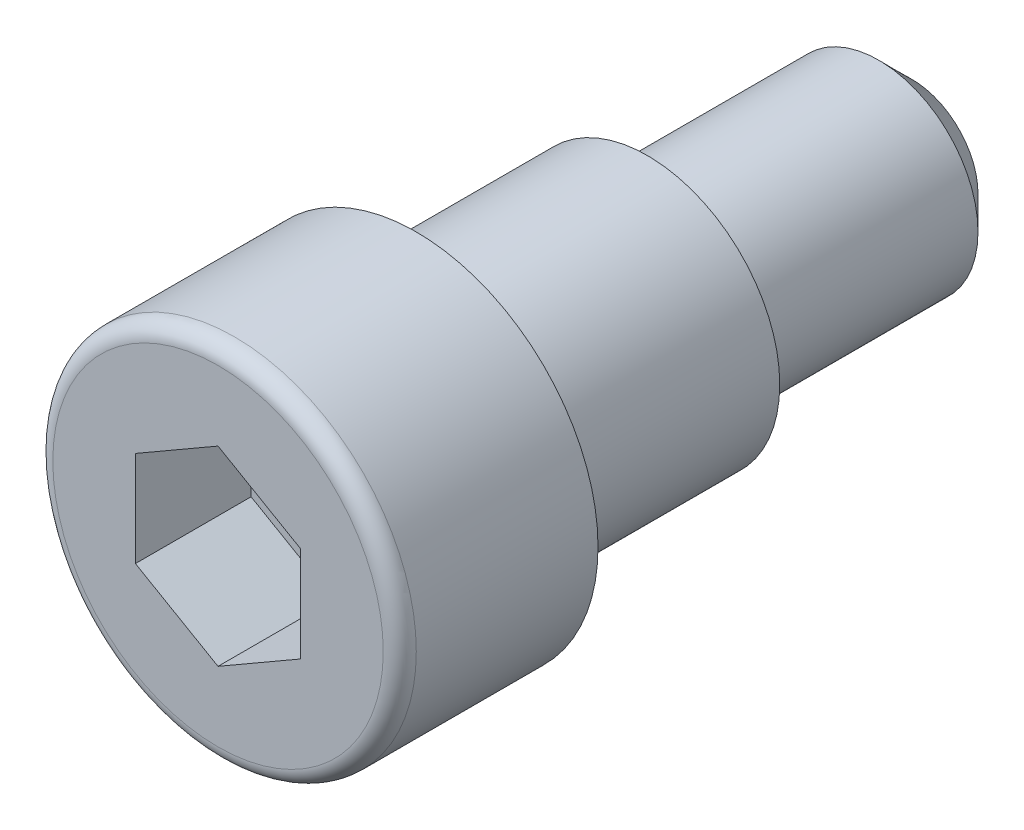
ISO-10303-21;
HEADER;
FILE_DESCRIPTION(('STEP AP214'),'2;1');
FILE_NAME('part.step','',(''),(''),'','','');
FILE_SCHEMA(('AUTOMOTIVE_DESIGN { 1 0 10303 214 1 1 1 1 }'));
ENDSEC;
DATA;
#1=APPLICATION_CONTEXT('core data for automotive mechanical design processes');
#2=APPLICATION_PROTOCOL_DEFINITION('international standard','automotive_design',2000,#1);
#3=PRODUCT_CONTEXT('',#1,'mechanical');
#4=PRODUCT('Part','Part','',(#3));
#5=PRODUCT_RELATED_PRODUCT_CATEGORY('part','',(#4));
#6=PRODUCT_DEFINITION_FORMATION('','',#4);
#7=PRODUCT_DEFINITION_CONTEXT('part definition',#1,'design');
#8=PRODUCT_DEFINITION('design','',#6,#7);
#9=PRODUCT_DEFINITION_SHAPE('','',#8);
#10=(LENGTH_UNIT() NAMED_UNIT(*) SI_UNIT(.MILLI.,.METRE.));
#11=(NAMED_UNIT(*) PLANE_ANGLE_UNIT() SI_UNIT($,.RADIAN.));
#12=(NAMED_UNIT(*) SI_UNIT($,.STERADIAN.) SOLID_ANGLE_UNIT());
#13=UNCERTAINTY_MEASURE_WITH_UNIT(LENGTH_MEASURE(1.E-05),#10,'distance_accuracy_value','');
#14=(GEOMETRIC_REPRESENTATION_CONTEXT(3) GLOBAL_UNCERTAINTY_ASSIGNED_CONTEXT((#13)) GLOBAL_UNIT_ASSIGNED_CONTEXT((#10,
#11,#12)) REPRESENTATION_CONTEXT('',''));
#15=CARTESIAN_POINT('',(0.,0.,0.));
#16=DIRECTION('',(0.,0.,1.));
#17=DIRECTION('',(1.,0.,0.));
#18=AXIS2_PLACEMENT_3D('',#15,#16,#17);
#19=CARTESIAN_POINT('',(0.,0.,-15.));
#20=DIRECTION('',(0.,0.,1.));
#21=DIRECTION('',(1.,0.,0.));
#22=AXIS2_PLACEMENT_3D('',#19,#20,#21);
#23=PLANE('',#22);
#24=CARTESIAN_POINT('',(0.,0.,-15.));
#25=DIRECTION('',(0.,0.,1.));
#26=DIRECTION('',(1.,0.,0.));
#27=AXIS2_PLACEMENT_3D('',#24,#25,#26);
#28=CIRCLE('',#27,2.);
#29=CARTESIAN_POINT('',(2.,0.,-15.));
#30=VERTEX_POINT('',#29);
#31=EDGE_CURVE('E9',#30,#30,#28,.F.);
#32=ORIENTED_EDGE('',*,*,#31,.T.);
#33=EDGE_LOOP('',(#32));
#34=FACE_BOUND('',#33,.T.);
#35=ADVANCED_FACE('F14',(#34),#23,.F.);
#36=CARTESIAN_POINT('',(0.,0.,6.));
#37=DIRECTION('',(0.,0.,-1.));
#38=DIRECTION('',(-1.,0.,0.));
#39=AXIS2_PLACEMENT_3D('',#36,#37,#38);
#40=PLANE('',#39);
#41=CARTESIAN_POINT('',(0.,0.,6.));
#42=DIRECTION('',(0.,0.,-1.));
#43=DIRECTION('',(-1.,0.,0.));
#44=AXIS2_PLACEMENT_3D('',#41,#42,#43);
#45=CIRCLE('',#44,5.);
#46=CARTESIAN_POINT('',(-5.,0.,6.));
#47=VERTEX_POINT('',#46);
#48=EDGE_CURVE('E133',#47,#47,#45,.F.);
#49=ORIENTED_EDGE('',*,*,#48,.T.);
#50=EDGE_LOOP('',(#49));
#51=FACE_BOUND('',#50,.T.);
#52=DIRECTION('',(-0.866025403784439,-0.5,0.));
#53=VECTOR('',#52,1.);
#54=CARTESIAN_POINT('',(0.,2.88675134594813,6.));
#55=LINE('',#54,#53);
#56=CARTESIAN_POINT('',(0.,2.88675134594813,6.));
#57=VERTEX_POINT('',#56);
#58=CARTESIAN_POINT('',(-2.5,1.44337567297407,6.));
#59=VERTEX_POINT('',#58);
#60=EDGE_CURVE('E103',#57,#59,#55,.T.);
#61=ORIENTED_EDGE('',*,*,#60,.F.);
#62=DIRECTION('',(-0.866025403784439,0.5,0.));
#63=VECTOR('',#62,1.);
#64=CARTESIAN_POINT('',(2.5,1.44337567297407,6.));
#65=LINE('',#64,#63);
#66=CARTESIAN_POINT('',(2.5,1.44337567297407,6.));
#67=VERTEX_POINT('',#66);
#68=EDGE_CURVE('E29',#67,#57,#65,.T.);
#69=ORIENTED_EDGE('',*,*,#68,.F.);
#70=DIRECTION('',(0.,1.,0.));
#71=VECTOR('',#70,1.);
#72=CARTESIAN_POINT('',(2.5,-1.44337567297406,6.));
#73=LINE('',#72,#71);
#74=CARTESIAN_POINT('',(2.5,-1.44337567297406,6.));
#75=VERTEX_POINT('',#74);
#76=EDGE_CURVE('E112',#75,#67,#73,.T.);
#77=ORIENTED_EDGE('',*,*,#76,.F.);
#78=DIRECTION('',(0.866025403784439,0.5,0.));
#79=VECTOR('',#78,1.);
#80=CARTESIAN_POINT('',(0.,-2.88675134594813,6.));
#81=LINE('',#80,#79);
#82=CARTESIAN_POINT('',(0.,-2.88675134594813,6.));
#83=VERTEX_POINT('',#82);
#84=EDGE_CURVE('E110',#83,#75,#81,.T.);
#85=ORIENTED_EDGE('',*,*,#84,.F.);
#86=DIRECTION('',(0.866025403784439,-0.5,0.));
#87=VECTOR('',#86,1.);
#88=CARTESIAN_POINT('',(-2.5,-1.44337567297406,6.));
#89=LINE('',#88,#87);
#90=CARTESIAN_POINT('',(-2.5,-1.44337567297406,6.));
#91=VERTEX_POINT('',#90);
#92=EDGE_CURVE('E77',#91,#83,#89,.T.);
#93=ORIENTED_EDGE('',*,*,#92,.F.);
#94=DIRECTION('',(0.,-1.,0.));
#95=VECTOR('',#94,1.);
#96=CARTESIAN_POINT('',(-2.5,1.44337567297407,6.));
#97=LINE('',#96,#95);
#98=EDGE_CURVE('E106',#59,#91,#97,.T.);
#99=ORIENTED_EDGE('',*,*,#98,.F.);
#100=EDGE_LOOP('',(#61,#69,#77,#85,#93,#99));
#101=FACE_BOUND('',#100,.T.);
#102=ADVANCED_FACE('F155',(#51,#101),#40,.F.);
#103=CARTESIAN_POINT('',(0.,0.,10.));
#104=DIRECTION('',(0.,0.,1.));
#105=DIRECTION('',(1.,0.,0.));
#106=AXIS2_PLACEMENT_3D('',#103,#104,#105);
#107=CYLINDRICAL_SURFACE('',#106,5.5);
#108=CARTESIAN_POINT('',(0.,0.,5.5));
#109=DIRECTION('',(0.,0.,-1.));
#110=DIRECTION('',(-1.,0.,0.));
#111=AXIS2_PLACEMENT_3D('',#108,#109,#110);
#112=CIRCLE('',#111,5.5);
#113=CARTESIAN_POINT('',(-5.5,0.,5.5));
#114=VERTEX_POINT('',#113);
#115=EDGE_CURVE('E136',#114,#114,#112,.T.);
#116=ORIENTED_EDGE('',*,*,#115,.T.);
#117=EDGE_LOOP('',(#116));
#118=FACE_BOUND('',#117,.T.);
#119=CARTESIAN_POINT('',(0.,0.,0.));
#120=DIRECTION('',(0.,0.,1.));
#121=DIRECTION('',(1.,0.,0.));
#122=AXIS2_PLACEMENT_3D('',#119,#120,#121);
#123=CIRCLE('',#122,5.5);
#124=CARTESIAN_POINT('',(5.5,0.,0.));
#125=VERTEX_POINT('',#124);
#126=EDGE_CURVE('E130',#125,#125,#123,.T.);
#127=ORIENTED_EDGE('',*,*,#126,.T.);
#128=EDGE_LOOP('',(#127));
#129=FACE_BOUND('',#128,.T.);
#130=ADVANCED_FACE('F162',(#118,#129),#107,.T.);
#131=CARTESIAN_POINT('',(0.,4.,0.));
#132=DIRECTION('',(0.,0.,1.));
#133=DIRECTION('',(1.,0.,0.));
#134=AXIS2_PLACEMENT_3D('',#131,#132,#133);
#135=PLANE('',#134);
#136=ORIENTED_EDGE('',*,*,#126,.F.);
#137=EDGE_LOOP('',(#136));
#138=FACE_BOUND('',#137,.T.);
#139=CARTESIAN_POINT('',(0.,0.,0.));
#140=DIRECTION('',(0.,0.,1.));
#141=DIRECTION('',(1.,0.,0.));
#142=AXIS2_PLACEMENT_3D('',#139,#140,#141);
#143=CIRCLE('',#142,4.);
#144=CARTESIAN_POINT('',(4.,0.,0.));
#145=VERTEX_POINT('',#144);
#146=EDGE_CURVE('E127',#145,#145,#143,.T.);
#147=ORIENTED_EDGE('',*,*,#146,.T.);
#148=EDGE_LOOP('',(#147));
#149=FACE_BOUND('',#148,.T.);
#150=ADVANCED_FACE('F168',(#138,#149),#135,.F.);
#151=CARTESIAN_POINT('',(0.,0.,10.));
#152=DIRECTION('',(0.,0.,1.));
#153=DIRECTION('',(1.,0.,0.));
#154=AXIS2_PLACEMENT_3D('',#151,#152,#153);
#155=CYLINDRICAL_SURFACE('',#154,4.);
#156=ORIENTED_EDGE('',*,*,#146,.F.);
#157=EDGE_LOOP('',(#156));
#158=FACE_BOUND('',#157,.T.);
#159=CARTESIAN_POINT('',(0.,0.,-7.));
#160=DIRECTION('',(0.,0.,1.));
#161=DIRECTION('',(1.,0.,0.));
#162=AXIS2_PLACEMENT_3D('',#159,#160,#161);
#163=CIRCLE('',#162,4.);
#164=CARTESIAN_POINT('',(4.,0.,-7.));
#165=VERTEX_POINT('',#164);
#166=EDGE_CURVE('E124',#165,#165,#163,.T.);
#167=ORIENTED_EDGE('',*,*,#166,.T.);
#168=EDGE_LOOP('',(#167));
#169=FACE_BOUND('',#168,.T.);
#170=ADVANCED_FACE('F172',(#158,#169),#155,.T.);
#171=CARTESIAN_POINT('',(0.,3.,-7.));
#172=DIRECTION('',(0.,0.,1.));
#173=DIRECTION('',(1.,0.,0.));
#174=AXIS2_PLACEMENT_3D('',#171,#172,#173);
#175=PLANE('',#174);
#176=ORIENTED_EDGE('',*,*,#166,.F.);
#177=EDGE_LOOP('',(#176));
#178=FACE_BOUND('',#177,.T.);
#179=CARTESIAN_POINT('',(0.,0.,-7.));
#180=DIRECTION('',(0.,0.,1.));
#181=DIRECTION('',(1.,0.,0.));
#182=AXIS2_PLACEMENT_3D('',#179,#180,#181);
#183=CIRCLE('',#182,3.);
#184=CARTESIAN_POINT('',(3.,0.,-7.));
#185=VERTEX_POINT('',#184);
#186=EDGE_CURVE('E116',#185,#185,#183,.T.);
#187=ORIENTED_EDGE('',*,*,#186,.T.);
#188=EDGE_LOOP('',(#187));
#189=FACE_BOUND('',#188,.T.);
#190=ADVANCED_FACE('F176',(#178,#189),#175,.F.);
#191=CARTESIAN_POINT('',(0.,0.,10.));
#192=DIRECTION('',(0.,0.,1.));
#193=DIRECTION('',(1.,0.,0.));
#194=AXIS2_PLACEMENT_3D('',#191,#192,#193);
#195=CYLINDRICAL_SURFACE('',#194,3.);
#196=CARTESIAN_POINT('',(0.,0.,-14.));
#197=DIRECTION('',(0.,0.,1.));
#198=DIRECTION('',(1.,0.,0.));
#199=AXIS2_PLACEMENT_3D('',#196,#197,#198);
#200=CIRCLE('',#199,3.);
#201=CARTESIAN_POINT('',(3.,0.,-14.));
#202=VERTEX_POINT('',#201);
#203=EDGE_CURVE('E22',#202,#202,#200,.T.);
#204=ORIENTED_EDGE('',*,*,#203,.T.);
#205=EDGE_LOOP('',(#204));
#206=FACE_BOUND('',#205,.T.);
#207=ORIENTED_EDGE('',*,*,#186,.F.);
#208=EDGE_LOOP('',(#207));
#209=FACE_BOUND('',#208,.T.);
#210=ADVANCED_FACE('F141',(#206,#209),#195,.T.);
#211=CARTESIAN_POINT('',(2.5,1.44337567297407,2.5));
#212=DIRECTION('',(0.5,0.866025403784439,0.));
#213=DIRECTION('',(-0.866025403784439,0.5,0.));
#214=AXIS2_PLACEMENT_3D('',#211,#212,#213);
#215=PLANE('',#214);
#216=ORIENTED_EDGE('',*,*,#68,.T.);
#217=DIRECTION('',(0.,0.,1.));
#218=VECTOR('',#217,1.);
#219=CARTESIAN_POINT('',(0.,2.88675134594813,2.5));
#220=LINE('',#219,#218);
#221=CARTESIAN_POINT('',(0.,2.88675134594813,2.5));
#222=VERTEX_POINT('',#221);
#223=EDGE_CURVE('E59',#222,#57,#220,.T.);
#224=ORIENTED_EDGE('',*,*,#223,.F.);
#225=DIRECTION('',(-0.866025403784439,0.5,0.));
#226=VECTOR('',#225,1.);
#227=CARTESIAN_POINT('',(2.5,1.44337567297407,2.5));
#228=LINE('',#227,#226);
#229=CARTESIAN_POINT('',(2.5,1.44337567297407,2.5));
#230=VERTEX_POINT('',#229);
#231=EDGE_CURVE('E114',#230,#222,#228,.T.);
#232=ORIENTED_EDGE('',*,*,#231,.F.);
#233=DIRECTION('',(0.,0.,1.));
#234=VECTOR('',#233,1.);
#235=CARTESIAN_POINT('',(2.5,1.44337567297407,2.5));
#236=LINE('',#235,#234);
#237=EDGE_CURVE('E37',#230,#67,#236,.T.);
#238=ORIENTED_EDGE('',*,*,#237,.T.);
#239=EDGE_LOOP('',(#216,#224,#232,#238));
#240=FACE_BOUND('',#239,.T.);
#241=ADVANCED_FACE('F183',(#240),#215,.F.);
#242=CARTESIAN_POINT('',(2.5,-1.44337567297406,2.5));
#243=DIRECTION('',(1.,0.,0.));
#244=DIRECTION('',(0.,0.,-1.));
#245=AXIS2_PLACEMENT_3D('',#242,#243,#244);
#246=PLANE('',#245);
#247=ORIENTED_EDGE('',*,*,#76,.T.);
#248=ORIENTED_EDGE('',*,*,#237,.F.);
#249=DIRECTION('',(0.,1.,0.));
#250=VECTOR('',#249,1.);
#251=CARTESIAN_POINT('',(2.5,-1.44337567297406,2.5));
#252=LINE('',#251,#250);
#253=CARTESIAN_POINT('',(2.5,-1.44337567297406,2.5));
#254=VERTEX_POINT('',#253);
#255=EDGE_CURVE('E89',#254,#230,#252,.T.);
#256=ORIENTED_EDGE('',*,*,#255,.F.);
#257=DIRECTION('',(0.,0.,1.));
#258=VECTOR('',#257,1.);
#259=CARTESIAN_POINT('',(2.5,-1.44337567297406,2.5));
#260=LINE('',#259,#258);
#261=EDGE_CURVE('E81',#254,#75,#260,.T.);
#262=ORIENTED_EDGE('',*,*,#261,.T.);
#263=EDGE_LOOP('',(#247,#248,#256,#262));
#264=FACE_BOUND('',#263,.T.);
#265=ADVANCED_FACE('F186',(#264),#246,.F.);
#266=CARTESIAN_POINT('',(0.,-2.88675134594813,2.5));
#267=DIRECTION('',(0.5,-0.866025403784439,0.));
#268=DIRECTION('',(0.866025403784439,0.5,0.));
#269=AXIS2_PLACEMENT_3D('',#266,#267,#268);
#270=PLANE('',#269);
#271=ORIENTED_EDGE('',*,*,#84,.T.);
#272=ORIENTED_EDGE('',*,*,#261,.F.);
#273=DIRECTION('',(0.866025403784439,0.5,0.));
#274=VECTOR('',#273,1.);
#275=CARTESIAN_POINT('',(0.,-2.88675134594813,2.5));
#276=LINE('',#275,#274);
#277=CARTESIAN_POINT('',(0.,-2.88675134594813,2.5));
#278=VERTEX_POINT('',#277);
#279=EDGE_CURVE('E85',#278,#254,#276,.T.);
#280=ORIENTED_EDGE('',*,*,#279,.F.);
#281=DIRECTION('',(0.,0.,1.));
#282=VECTOR('',#281,1.);
#283=CARTESIAN_POINT('',(0.,-2.88675134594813,2.5));
#284=LINE('',#283,#282);
#285=EDGE_CURVE('E70',#278,#83,#284,.T.);
#286=ORIENTED_EDGE('',*,*,#285,.T.);
#287=EDGE_LOOP('',(#271,#272,#280,#286));
#288=FACE_BOUND('',#287,.T.);
#289=ADVANCED_FACE('F86',(#288),#270,.F.);
#290=CARTESIAN_POINT('',(-2.5,-1.44337567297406,2.5));
#291=DIRECTION('',(-0.5,-0.866025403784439,0.));
#292=DIRECTION('',(0.866025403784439,-0.5,0.));
#293=AXIS2_PLACEMENT_3D('',#290,#291,#292);
#294=PLANE('',#293);
#295=ORIENTED_EDGE('',*,*,#92,.T.);
#296=ORIENTED_EDGE('',*,*,#285,.F.);
#297=DIRECTION('',(0.866025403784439,-0.5,0.));
#298=VECTOR('',#297,1.);
#299=CARTESIAN_POINT('',(-2.5,-1.44337567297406,2.5));
#300=LINE('',#299,#298);
#301=CARTESIAN_POINT('',(-2.5,-1.44337567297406,2.5));
#302=VERTEX_POINT('',#301);
#303=EDGE_CURVE('E74',#302,#278,#300,.T.);
#304=ORIENTED_EDGE('',*,*,#303,.F.);
#305=DIRECTION('',(0.,0.,1.));
#306=VECTOR('',#305,1.);
#307=CARTESIAN_POINT('',(-2.5,-1.44337567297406,2.5));
#308=LINE('',#307,#306);
#309=EDGE_CURVE('E82',#302,#91,#308,.T.);
#310=ORIENTED_EDGE('',*,*,#309,.T.);
#311=EDGE_LOOP('',(#295,#296,#304,#310));
#312=FACE_BOUND('',#311,.T.);
#313=ADVANCED_FACE('F72',(#312),#294,.F.);
#314=CARTESIAN_POINT('',(-2.5,1.44337567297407,2.5));
#315=DIRECTION('',(-1.,0.,0.));
#316=DIRECTION('',(0.,-1.,0.));
#317=AXIS2_PLACEMENT_3D('',#314,#315,#316);
#318=PLANE('',#317);
#319=ORIENTED_EDGE('',*,*,#98,.T.);
#320=ORIENTED_EDGE('',*,*,#309,.F.);
#321=DIRECTION('',(0.,-1.,0.));
#322=VECTOR('',#321,1.);
#323=CARTESIAN_POINT('',(-2.5,1.44337567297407,2.5));
#324=LINE('',#323,#322);
#325=CARTESIAN_POINT('',(-2.5,1.44337567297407,2.5));
#326=VERTEX_POINT('',#325);
#327=EDGE_CURVE('E95',#326,#302,#324,.T.);
#328=ORIENTED_EDGE('',*,*,#327,.F.);
#329=DIRECTION('',(0.,0.,1.));
#330=VECTOR('',#329,1.);
#331=CARTESIAN_POINT('',(-2.5,1.44337567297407,2.5));
#332=LINE('',#331,#330);
#333=EDGE_CURVE('E119',#326,#59,#332,.T.);
#334=ORIENTED_EDGE('',*,*,#333,.T.);
#335=EDGE_LOOP('',(#319,#320,#328,#334));
#336=FACE_BOUND('',#335,.T.);
#337=ADVANCED_FACE('F190',(#336),#318,.F.);
#338=CARTESIAN_POINT('',(0.,2.88675134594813,2.5));
#339=DIRECTION('',(-0.5,0.866025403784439,0.));
#340=DIRECTION('',(-0.866025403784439,-0.5,0.));
#341=AXIS2_PLACEMENT_3D('',#338,#339,#340);
#342=PLANE('',#341);
#343=ORIENTED_EDGE('',*,*,#60,.T.);
#344=ORIENTED_EDGE('',*,*,#333,.F.);
#345=DIRECTION('',(-0.866025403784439,-0.5,0.));
#346=VECTOR('',#345,1.);
#347=CARTESIAN_POINT('',(0.,2.88675134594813,2.5));
#348=LINE('',#347,#346);
#349=EDGE_CURVE('E97',#222,#326,#348,.T.);
#350=ORIENTED_EDGE('',*,*,#349,.F.);
#351=ORIENTED_EDGE('',*,*,#223,.T.);
#352=EDGE_LOOP('',(#343,#344,#350,#351));
#353=FACE_BOUND('',#352,.T.);
#354=ADVANCED_FACE('F187',(#353),#342,.F.);
#355=CARTESIAN_POINT('',(0.,2.88675134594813,2.5));
#356=DIRECTION('',(0.,0.,1.));
#357=DIRECTION('',(1.,0.,0.));
#358=AXIS2_PLACEMENT_3D('',#355,#356,#357);
#359=PLANE('',#358);
#360=ORIENTED_EDGE('',*,*,#231,.T.);
#361=ORIENTED_EDGE('',*,*,#349,.T.);
#362=ORIENTED_EDGE('',*,*,#327,.T.);
#363=ORIENTED_EDGE('',*,*,#303,.T.);
#364=ORIENTED_EDGE('',*,*,#279,.T.);
#365=ORIENTED_EDGE('',*,*,#255,.T.);
#366=EDGE_LOOP('',(#360,#361,#362,#363,#364,#365));
#367=FACE_BOUND('',#366,.T.);
#368=ADVANCED_FACE('F92',(#367),#359,.T.);
#369=CARTESIAN_POINT('',(0.,0.,5.5));
#370=DIRECTION('',(0.,0.,-1.));
#371=DIRECTION('',(-1.,0.,0.));
#372=AXIS2_PLACEMENT_3D('',#369,#370,#371);
#373=TOROIDAL_SURFACE('',#372,5.,0.5);
#374=ORIENTED_EDGE('',*,*,#115,.F.);
#375=EDGE_LOOP('',(#374));
#376=FACE_BOUND('',#375,.T.);
#377=ORIENTED_EDGE('',*,*,#48,.F.);
#378=EDGE_LOOP('',(#377));
#379=FACE_BOUND('',#378,.T.);
#380=ADVANCED_FACE('F145',(#376,#379),#373,.T.);
#381=CARTESIAN_POINT('',(0.,0.,-14.));
#382=DIRECTION('',(0.,0.,1.));
#383=DIRECTION('',(1.,0.,0.));
#384=AXIS2_PLACEMENT_3D('',#381,#382,#383);
#385=CONICAL_SURFACE('',#384,3.,0.78539816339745);
#386=ORIENTED_EDGE('',*,*,#31,.F.);
#387=EDGE_LOOP('',(#386));
#388=FACE_BOUND('',#387,.T.);
#389=ORIENTED_EDGE('',*,*,#203,.F.);
#390=EDGE_LOOP('',(#389));
#391=FACE_BOUND('',#390,.T.);
#392=ADVANCED_FACE('F16',(#388,#391),#385,.T.);
#393=CLOSED_SHELL('',(#35,#102,#130,#150,#170,#190,#210,#241,#265,#289,#313,#337,#354,#368,#380,#392));
#394=MANIFOLD_SOLID_BREP('B1',#393);
#395=ADVANCED_BREP_SHAPE_REPRESENTATION('',(#18,#394),#14);
#396=SHAPE_DEFINITION_REPRESENTATION(#9,#395);
ENDSEC;
END-ISO-10303-21;
